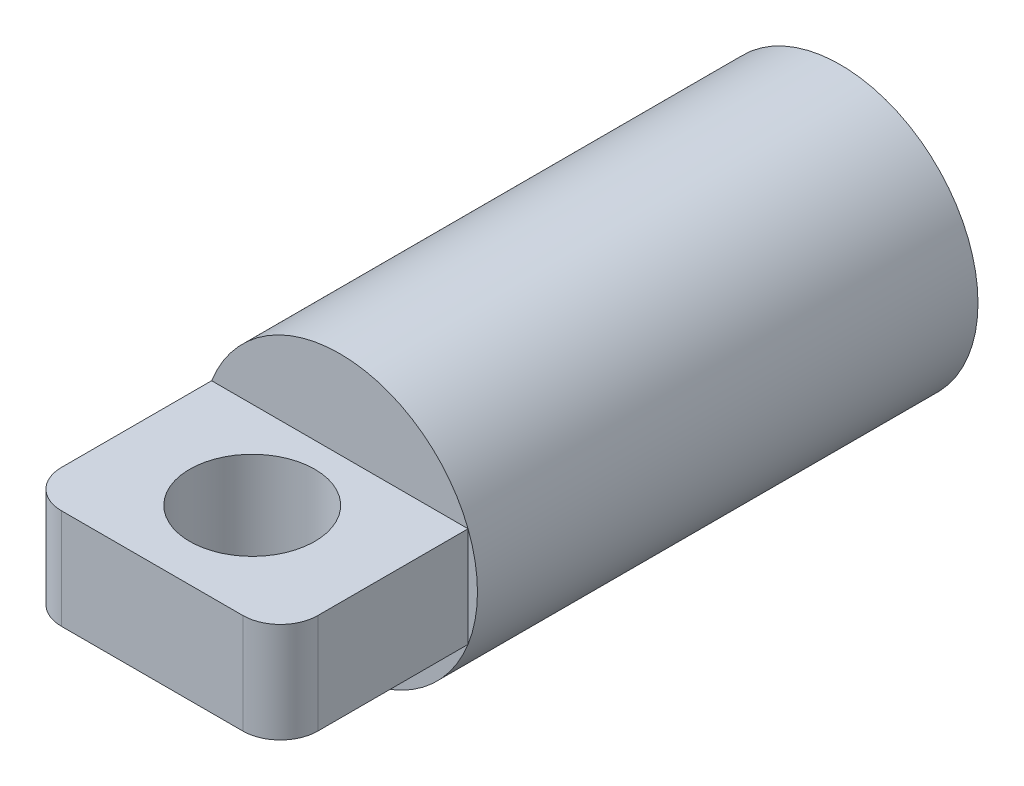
from build123d import *

# Parameters (mm, degrees)
SKETCH1_R           = 11
BOSS_EXTRUDE1_DEPTH = 55
SKETCH2_OUTSIDE_W   = 36.638
SKETCH2_OUTSIDE_H   = 36.638
SKETCH2_OUTSIDE_W_2 = 20.493901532
SKETCH2_OUTSIDE_H_2 = 8
CUT_EXTRUDE1_DEPTH  = 15
FILLET2_R           = 3
SKETCH4_R           = 5
CUT_EXTRUDE2_DEPTH  = 8


with BuildPart() as part:
    # Sketch1 → Boss-Extrude1 (new body)
    with BuildSketch(Plane.XY):
        Circle(SKETCH1_R)
    extrude(amount=BOSS_EXTRUDE1_DEPTH)

    # Sketch2 outside → Cut-Extrude1 (cut)
    with BuildSketch(Plane.XY.offset(55)):
        Rectangle(SKETCH2_OUTSIDE_W, SKETCH2_OUTSIDE_H)
        Rectangle(SKETCH2_OUTSIDE_W_2, SKETCH2_OUTSIDE_H_2, mode=Mode.SUBTRACT)
    extrude(amount=-CUT_EXTRUDE1_DEPTH, mode=Mode.SUBTRACT)

    # Fillet2
    fillet2_edges = [part.edges().sort_by_distance(p)[0] for p in [
        (10.246950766, 0, 55),
        (-10.246950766, 0, 55),
    ]]
    fillet(fillet2_edges, radius=FILLET2_R)

    # Sketch4 → Cut-Extrude2 (cut)
    with BuildSketch(Plane.XZ.offset(4)):
        with Locations(Location((0, 47, 0), (0, 0, 270))):
            Circle(SKETCH4_R)
    extrude(amount=-CUT_EXTRUDE2_DEPTH, mode=Mode.SUBTRACT)


solid = part.part
